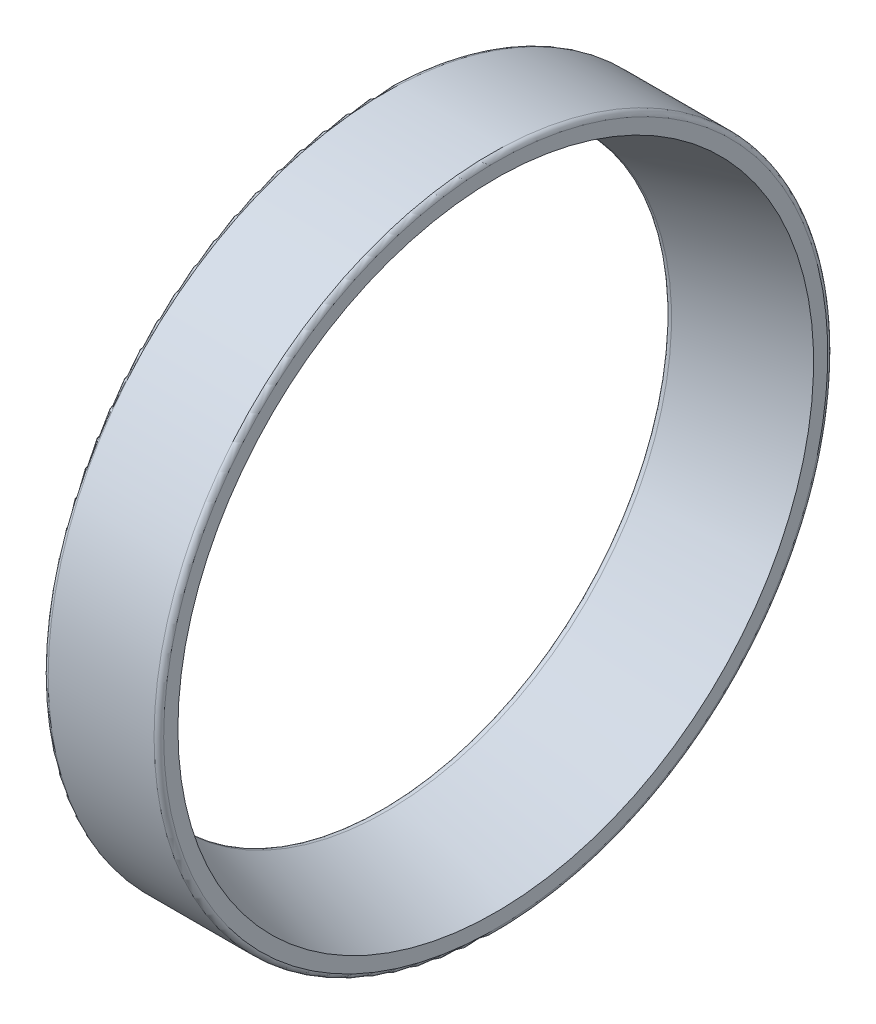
ISO-10303-21;
HEADER;
FILE_DESCRIPTION(('STEP AP214'),'2;1');
FILE_NAME('part.step','',(''),(''),'','','');
FILE_SCHEMA(('AUTOMOTIVE_DESIGN { 1 0 10303 214 1 1 1 1 }'));
ENDSEC;
DATA;
#1=APPLICATION_CONTEXT('core data for automotive mechanical design processes');
#2=APPLICATION_PROTOCOL_DEFINITION('international standard','automotive_design',2000,#1);
#3=PRODUCT_CONTEXT('',#1,'mechanical');
#4=PRODUCT('Part','Part','',(#3));
#5=PRODUCT_RELATED_PRODUCT_CATEGORY('part','',(#4));
#6=PRODUCT_DEFINITION_FORMATION('','',#4);
#7=PRODUCT_DEFINITION_CONTEXT('part definition',#1,'design');
#8=PRODUCT_DEFINITION('design','',#6,#7);
#9=PRODUCT_DEFINITION_SHAPE('','',#8);
#10=(LENGTH_UNIT() NAMED_UNIT(*) SI_UNIT(.MILLI.,.METRE.));
#11=(NAMED_UNIT(*) PLANE_ANGLE_UNIT() SI_UNIT($,.RADIAN.));
#12=(NAMED_UNIT(*) SI_UNIT($,.STERADIAN.) SOLID_ANGLE_UNIT());
#13=UNCERTAINTY_MEASURE_WITH_UNIT(LENGTH_MEASURE(1.E-05),#10,'distance_accuracy_value','');
#14=(GEOMETRIC_REPRESENTATION_CONTEXT(3) GLOBAL_UNCERTAINTY_ASSIGNED_CONTEXT((#13)) GLOBAL_UNIT_ASSIGNED_CONTEXT((#10,
#11,#12)) REPRESENTATION_CONTEXT('',''));
#15=CARTESIAN_POINT('',(0.,0.,0.));
#16=DIRECTION('',(0.,0.,1.));
#17=DIRECTION('',(1.,0.,0.));
#18=AXIS2_PLACEMENT_3D('',#15,#16,#17);
#19=CARTESIAN_POINT('',(1.,0.,0.));
#20=DIRECTION('',(-1.,0.,0.));
#21=DIRECTION('',(0.,0.,1.));
#22=AXIS2_PLACEMENT_3D('',#19,#20,#21);
#23=TOROIDAL_SURFACE('',#22,60.1973061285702,1.00000000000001);
#24=CARTESIAN_POINT('',(1.28709336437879,0.,0.));
#25=DIRECTION('',(-1.,0.,0.));
#26=DIRECTION('',(0.,0.,1.));
#27=AXIS2_PLACEMENT_3D('',#24,#25,#26);
#28=CIRCLE('',#27,59.23940352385);
#29=CARTESIAN_POINT('',(1.28709336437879,0.,59.23940352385));
#30=VERTEX_POINT('',#29);
#31=EDGE_CURVE('E10',#30,#30,#28,.T.);
#32=ORIENTED_EDGE('',*,*,#31,.F.);
#33=EDGE_LOOP('',(#32));
#34=FACE_BOUND('',#33,.T.);
#35=CARTESIAN_POINT('',(0.,0.,0.));
#36=DIRECTION('',(-1.,0.,0.));
#37=DIRECTION('',(0.,0.,1.));
#38=AXIS2_PLACEMENT_3D('',#35,#36,#37);
#39=CIRCLE('',#38,60.1973061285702);
#40=CARTESIAN_POINT('',(0.,0.,60.1973061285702));
#41=VERTEX_POINT('',#40);
#42=EDGE_CURVE('E54',#41,#41,#39,.T.);
#43=ORIENTED_EDGE('',*,*,#42,.T.);
#44=EDGE_LOOP('',(#43));
#45=FACE_BOUND('',#44,.T.);
#46=ADVANCED_FACE('F29',(#34,#45),#23,.T.);
#47=CARTESIAN_POINT('',(21.0429104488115,0.,0.));
#48=DIRECTION('',(1.,0.,0.));
#49=DIRECTION('',(0.,0.,-1.));
#50=AXIS2_PLACEMENT_3D('',#47,#48,#49);
#51=CONICAL_SURFACE('',#50,65.1604271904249,0.291191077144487);
#52=CARTESIAN_POINT('',(24.,0.,0.));
#53=DIRECTION('',(-1.,0.,0.));
#54=DIRECTION('',(0.,0.,1.));
#55=AXIS2_PLACEMENT_3D('',#52,#53,#54);
#56=CIRCLE('',#55,66.0466976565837);
#57=CARTESIAN_POINT('',(24.,0.,66.0466976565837));
#58=VERTEX_POINT('',#57);
#59=EDGE_CURVE('E35',#58,#58,#56,.T.);
#60=ORIENTED_EDGE('',*,*,#59,.F.);
#61=EDGE_LOOP('',(#60));
#62=FACE_BOUND('',#61,.T.);
#63=ORIENTED_EDGE('',*,*,#31,.T.);
#64=EDGE_LOOP('',(#63));
#65=FACE_BOUND('',#64,.T.);
#66=ADVANCED_FACE('F85',(#62,#65),#51,.F.);
#67=CARTESIAN_POINT('',(24.,0.,-69.));
#68=DIRECTION('',(-1.,0.,0.));
#69=DIRECTION('',(0.,0.,1.));
#70=AXIS2_PLACEMENT_3D('',#67,#68,#69);
#71=PLANE('',#70);
#72=CARTESIAN_POINT('',(24.,0.,0.));
#73=DIRECTION('',(-1.,0.,0.));
#74=DIRECTION('',(0.,0.,1.));
#75=AXIS2_PLACEMENT_3D('',#72,#73,#74);
#76=CIRCLE('',#75,69.);
#77=CARTESIAN_POINT('',(24.,0.,69.));
#78=VERTEX_POINT('',#77);
#79=EDGE_CURVE('E39',#78,#78,#76,.T.);
#80=ORIENTED_EDGE('',*,*,#79,.F.);
#81=EDGE_LOOP('',(#80));
#82=FACE_BOUND('',#81,.T.);
#83=ORIENTED_EDGE('',*,*,#59,.T.);
#84=EDGE_LOOP('',(#83));
#85=FACE_BOUND('',#84,.T.);
#86=ADVANCED_FACE('F80',(#82,#85),#71,.F.);
#87=CARTESIAN_POINT('',(23.,0.,0.));
#88=DIRECTION('',(-1.,0.,0.));
#89=DIRECTION('',(0.,0.,1.));
#90=AXIS2_PLACEMENT_3D('',#87,#88,#89);
#91=TOROIDAL_SURFACE('',#90,69.,1.);
#92=CARTESIAN_POINT('',(23.,0.,0.));
#93=DIRECTION('',(-1.,0.,0.));
#94=DIRECTION('',(0.,0.,1.));
#95=AXIS2_PLACEMENT_3D('',#92,#93,#94);
#96=CIRCLE('',#95,70.);
#97=CARTESIAN_POINT('',(23.,0.,70.));
#98=VERTEX_POINT('',#97);
#99=EDGE_CURVE('E43',#98,#98,#96,.T.);
#100=ORIENTED_EDGE('',*,*,#99,.F.);
#101=EDGE_LOOP('',(#100));
#102=FACE_BOUND('',#101,.T.);
#103=ORIENTED_EDGE('',*,*,#79,.T.);
#104=EDGE_LOOP('',(#103));
#105=FACE_BOUND('',#104,.T.);
#106=ADVANCED_FACE('F74',(#102,#105),#91,.T.);
#107=CARTESIAN_POINT('',(0.,0.,0.));
#108=DIRECTION('',(-1.,0.,0.));
#109=DIRECTION('',(0.,0.,1.));
#110=AXIS2_PLACEMENT_3D('',#107,#108,#109);
#111=CYLINDRICAL_SURFACE('',#110,70.);
#112=CARTESIAN_POINT('',(1.,0.,0.));
#113=DIRECTION('',(-1.,0.,0.));
#114=DIRECTION('',(0.,0.,1.));
#115=AXIS2_PLACEMENT_3D('',#112,#113,#114);
#116=CIRCLE('',#115,70.);
#117=CARTESIAN_POINT('',(1.,0.,70.));
#118=VERTEX_POINT('',#117);
#119=EDGE_CURVE('E48',#118,#118,#116,.T.);
#120=ORIENTED_EDGE('',*,*,#119,.F.);
#121=EDGE_LOOP('',(#120));
#122=FACE_BOUND('',#121,.T.);
#123=ORIENTED_EDGE('',*,*,#99,.T.);
#124=EDGE_LOOP('',(#123));
#125=FACE_BOUND('',#124,.T.);
#126=ADVANCED_FACE('F68',(#122,#125),#111,.T.);
#127=CARTESIAN_POINT('',(1.,0.,0.));
#128=DIRECTION('',(-1.,0.,0.));
#129=DIRECTION('',(0.,0.,1.));
#130=AXIS2_PLACEMENT_3D('',#127,#128,#129);
#131=TOROIDAL_SURFACE('',#130,69.,1.);
#132=CARTESIAN_POINT('',(0.,0.,0.));
#133=DIRECTION('',(-1.,0.,0.));
#134=DIRECTION('',(0.,0.,1.));
#135=AXIS2_PLACEMENT_3D('',#132,#133,#134);
#136=CIRCLE('',#135,69.);
#137=CARTESIAN_POINT('',(0.,0.,69.));
#138=VERTEX_POINT('',#137);
#139=EDGE_CURVE('E51',#138,#138,#136,.T.);
#140=ORIENTED_EDGE('',*,*,#139,.F.);
#141=EDGE_LOOP('',(#140));
#142=FACE_BOUND('',#141,.T.);
#143=ORIENTED_EDGE('',*,*,#119,.T.);
#144=EDGE_LOOP('',(#143));
#145=FACE_BOUND('',#144,.T.);
#146=ADVANCED_FACE('F62',(#142,#145),#131,.T.);
#147=CARTESIAN_POINT('',(0.,0.,-60.1973061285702));
#148=DIRECTION('',(1.,0.,0.));
#149=DIRECTION('',(0.,0.,-1.));
#150=AXIS2_PLACEMENT_3D('',#147,#148,#149);
#151=PLANE('',#150);
#152=ORIENTED_EDGE('',*,*,#42,.F.);
#153=EDGE_LOOP('',(#152));
#154=FACE_BOUND('',#153,.T.);
#155=ORIENTED_EDGE('',*,*,#139,.T.);
#156=EDGE_LOOP('',(#155));
#157=FACE_BOUND('',#156,.T.);
#158=ADVANCED_FACE('F59',(#154,#157),#151,.F.);
#159=CLOSED_SHELL('',(#46,#66,#86,#106,#126,#146,#158));
#160=MANIFOLD_SOLID_BREP('B2',#159);
#161=ADVANCED_BREP_SHAPE_REPRESENTATION('',(#18,#160),#14);
#162=SHAPE_DEFINITION_REPRESENTATION(#9,#161);
ENDSEC;
END-ISO-10303-21;
